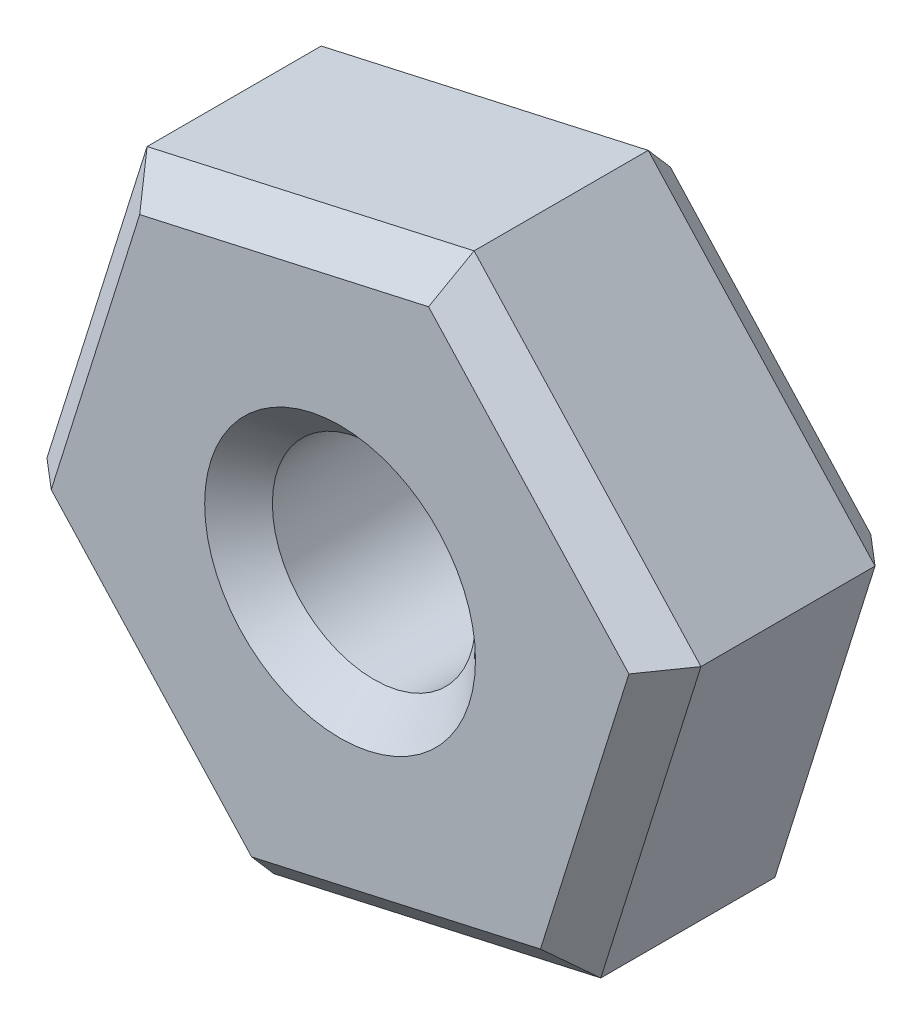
ISO-10303-21;
HEADER;
FILE_DESCRIPTION(('STEP AP214'),'2;1');
FILE_NAME('part.step','',(''),(''),'','','');
FILE_SCHEMA(('AUTOMOTIVE_DESIGN { 1 0 10303 214 1 1 1 1 }'));
ENDSEC;
DATA;
#1=APPLICATION_CONTEXT('core data for automotive mechanical design processes');
#2=APPLICATION_PROTOCOL_DEFINITION('international standard','automotive_design',2000,#1);
#3=PRODUCT_CONTEXT('',#1,'mechanical');
#4=PRODUCT('Part','Part','',(#3));
#5=PRODUCT_RELATED_PRODUCT_CATEGORY('part','',(#4));
#6=PRODUCT_DEFINITION_FORMATION('','',#4);
#7=PRODUCT_DEFINITION_CONTEXT('part definition',#1,'design');
#8=PRODUCT_DEFINITION('design','',#6,#7);
#9=PRODUCT_DEFINITION_SHAPE('','',#8);
#10=(LENGTH_UNIT() NAMED_UNIT(*) SI_UNIT(.MILLI.,.METRE.));
#11=(NAMED_UNIT(*) PLANE_ANGLE_UNIT() SI_UNIT($,.RADIAN.));
#12=(NAMED_UNIT(*) SI_UNIT($,.STERADIAN.) SOLID_ANGLE_UNIT());
#13=UNCERTAINTY_MEASURE_WITH_UNIT(LENGTH_MEASURE(1.E-05),#10,'distance_accuracy_value','');
#14=(GEOMETRIC_REPRESENTATION_CONTEXT(3) GLOBAL_UNCERTAINTY_ASSIGNED_CONTEXT((#13)) GLOBAL_UNIT_ASSIGNED_CONTEXT((#10,
#11,#12)) REPRESENTATION_CONTEXT('',''));
#15=CARTESIAN_POINT('',(0.,0.,0.));
#16=DIRECTION('',(0.,0.,1.));
#17=DIRECTION('',(1.,0.,0.));
#18=AXIS2_PLACEMENT_3D('',#15,#16,#17);
#19=CARTESIAN_POINT('',(-2.0706265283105,-6.61154337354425,5.));
#20=DIRECTION('',(-0.21831872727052,0.975877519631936,0.));
#21=DIRECTION('',(-0.975877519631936,-0.21831872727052,0.));
#22=AXIS2_PLACEMENT_3D('',#19,#20,#21);
#23=PLANE('',#22);
#24=DIRECTION('',(0.,0.,-1.));
#25=VECTOR('',#24,1.);
#26=CARTESIAN_POINT('',(-2.0706265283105,-6.61154337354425,5.));
#27=LINE('',#26,#25);
#28=CARTESIAN_POINT('',(-2.0706265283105,-6.61154337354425,4.3));
#29=VERTEX_POINT('',#28);
#30=CARTESIAN_POINT('',(-2.0706265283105,-6.61154337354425,0.7));
#31=VERTEX_POINT('',#30);
#32=EDGE_CURVE('E214',#29,#31,#27,.T.);
#33=ORIENTED_EDGE('',*,*,#32,.T.);
#34=DIRECTION('',(0.975877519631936,0.21831872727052,0.));
#35=VECTOR('',#34,1.);
#36=CARTESIAN_POINT('',(-2.0706265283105,-6.61154337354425,0.7));
#37=LINE('',#36,#35);
#38=CARTESIAN_POINT('',(4.69045125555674,-5.098986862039,0.7));
#39=VERTEX_POINT('',#38);
#40=EDGE_CURVE('E180',#31,#39,#37,.T.);
#41=ORIENTED_EDGE('',*,*,#40,.T.);
#42=DIRECTION('',(0.,0.,-1.));
#43=VECTOR('',#42,1.);
#44=CARTESIAN_POINT('',(4.69045125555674,-5.098986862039,5.));
#45=LINE('',#44,#43);
#46=CARTESIAN_POINT('',(4.69045125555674,-5.098986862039,4.3));
#47=VERTEX_POINT('',#46);
#48=EDGE_CURVE('E130',#47,#39,#45,.T.);
#49=ORIENTED_EDGE('',*,*,#48,.F.);
#50=DIRECTION('',(-0.975877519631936,-0.21831872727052,0.));
#51=VECTOR('',#50,1.);
#52=CARTESIAN_POINT('',(-2.0706265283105,-6.61154337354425,4.3));
#53=LINE('',#52,#51);
#54=EDGE_CURVE('E178',#47,#29,#53,.T.);
#55=ORIENTED_EDGE('',*,*,#54,.T.);
#56=EDGE_LOOP('',(#33,#41,#49,#55));
#57=FACE_BOUND('',#56,.T.);
#58=ADVANCED_FACE('F18',(#57),#23,.F.);
#59=CARTESIAN_POINT('',(4.69045125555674,-5.098986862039,5.));
#60=DIRECTION('',(-0.954294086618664,0.298869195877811,0.));
#61=DIRECTION('',(-0.298869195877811,-0.954294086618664,0.));
#62=AXIS2_PLACEMENT_3D('',#59,#60,#61);
#63=PLANE('',#62);
#64=ORIENTED_EDGE('',*,*,#48,.T.);
#65=DIRECTION('',(0.298869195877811,0.954294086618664,0.));
#66=VECTOR('',#65,1.);
#67=CARTESIAN_POINT('',(4.69045125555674,-5.098986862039,0.7));
#68=LINE('',#67,#66);
#69=CARTESIAN_POINT('',(6.76107778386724,1.51255651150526,0.7));
#70=VERTEX_POINT('',#69);
#71=EDGE_CURVE('E129',#39,#70,#68,.T.);
#72=ORIENTED_EDGE('',*,*,#71,.T.);
#73=DIRECTION('',(0.,0.,-1.));
#74=VECTOR('',#73,1.);
#75=CARTESIAN_POINT('',(6.76107778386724,1.51255651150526,5.));
#76=LINE('',#75,#74);
#77=CARTESIAN_POINT('',(6.76107778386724,1.51255651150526,4.3));
#78=VERTEX_POINT('',#77);
#79=EDGE_CURVE('E111',#78,#70,#76,.T.);
#80=ORIENTED_EDGE('',*,*,#79,.F.);
#81=DIRECTION('',(-0.298869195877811,-0.954294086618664,0.));
#82=VECTOR('',#81,1.);
#83=CARTESIAN_POINT('',(4.69045125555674,-5.098986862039,4.3));
#84=LINE('',#83,#82);
#85=EDGE_CURVE('E126',#78,#47,#84,.T.);
#86=ORIENTED_EDGE('',*,*,#85,.T.);
#87=EDGE_LOOP('',(#64,#72,#80,#86));
#88=FACE_BOUND('',#87,.T.);
#89=ADVANCED_FACE('F124',(#88),#63,.F.);
#90=CARTESIAN_POINT('',(6.76107778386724,1.51255651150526,5.));
#91=DIRECTION('',(-0.735975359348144,-0.677008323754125,0.));
#92=DIRECTION('',(0.677008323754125,-0.735975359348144,0.));
#93=AXIS2_PLACEMENT_3D('',#90,#91,#92);
#94=PLANE('',#93);
#95=ORIENTED_EDGE('',*,*,#79,.T.);
#96=DIRECTION('',(-0.677008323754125,0.735975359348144,0.));
#97=VECTOR('',#96,1.);
#98=CARTESIAN_POINT('',(6.76107778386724,1.51255651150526,0.7));
#99=LINE('',#98,#97);
#100=CARTESIAN_POINT('',(2.0706265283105,6.61154337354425,0.7));
#101=VERTEX_POINT('',#100);
#102=EDGE_CURVE('E118',#70,#101,#99,.T.);
#103=ORIENTED_EDGE('',*,*,#102,.T.);
#104=DIRECTION('',(0.,0.,-1.));
#105=VECTOR('',#104,1.);
#106=CARTESIAN_POINT('',(2.0706265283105,6.61154337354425,5.));
#107=LINE('',#106,#105);
#108=CARTESIAN_POINT('',(2.0706265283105,6.61154337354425,4.3));
#109=VERTEX_POINT('',#108);
#110=EDGE_CURVE('E113',#109,#101,#107,.T.);
#111=ORIENTED_EDGE('',*,*,#110,.F.);
#112=DIRECTION('',(0.677008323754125,-0.735975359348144,0.));
#113=VECTOR('',#112,1.);
#114=CARTESIAN_POINT('',(6.76107778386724,1.51255651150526,4.3));
#115=LINE('',#114,#113);
#116=EDGE_CURVE('E108',#109,#78,#115,.T.);
#117=ORIENTED_EDGE('',*,*,#116,.T.);
#118=EDGE_LOOP('',(#95,#103,#111,#117));
#119=FACE_BOUND('',#118,.T.);
#120=ADVANCED_FACE('F110',(#119),#94,.F.);
#121=CARTESIAN_POINT('',(2.0706265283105,6.61154337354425,5.));
#122=DIRECTION('',(0.21831872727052,-0.975877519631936,0.));
#123=DIRECTION('',(0.975877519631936,0.21831872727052,0.));
#124=AXIS2_PLACEMENT_3D('',#121,#122,#123);
#125=PLANE('',#124);
#126=ORIENTED_EDGE('',*,*,#110,.T.);
#127=DIRECTION('',(-0.975877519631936,-0.21831872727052,0.));
#128=VECTOR('',#127,1.);
#129=CARTESIAN_POINT('',(2.0706265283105,6.61154337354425,0.7));
#130=LINE('',#129,#128);
#131=CARTESIAN_POINT('',(-4.69045125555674,5.09898686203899,0.7));
#132=VERTEX_POINT('',#131);
#133=EDGE_CURVE('E167',#101,#132,#130,.T.);
#134=ORIENTED_EDGE('',*,*,#133,.T.);
#135=DIRECTION('',(0.,0.,-1.));
#136=VECTOR('',#135,1.);
#137=CARTESIAN_POINT('',(-4.69045125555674,5.09898686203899,5.));
#138=LINE('',#137,#136);
#139=CARTESIAN_POINT('',(-4.69045125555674,5.09898686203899,4.3));
#140=VERTEX_POINT('',#139);
#141=EDGE_CURVE('E232',#140,#132,#138,.T.);
#142=ORIENTED_EDGE('',*,*,#141,.F.);
#143=DIRECTION('',(0.975877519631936,0.21831872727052,0.));
#144=VECTOR('',#143,1.);
#145=CARTESIAN_POINT('',(2.0706265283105,6.61154337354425,4.3));
#146=LINE('',#145,#144);
#147=EDGE_CURVE('E165',#140,#109,#146,.T.);
#148=ORIENTED_EDGE('',*,*,#147,.T.);
#149=EDGE_LOOP('',(#126,#134,#142,#148));
#150=FACE_BOUND('',#149,.T.);
#151=ADVANCED_FACE('F229',(#150),#125,.F.);
#152=CARTESIAN_POINT('',(-4.69045125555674,5.09898686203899,5.));
#153=DIRECTION('',(0.954294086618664,-0.298869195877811,0.));
#154=DIRECTION('',(0.298869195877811,0.954294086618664,0.));
#155=AXIS2_PLACEMENT_3D('',#152,#153,#154);
#156=PLANE('',#155);
#157=ORIENTED_EDGE('',*,*,#141,.T.);
#158=DIRECTION('',(-0.298869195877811,-0.954294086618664,0.));
#159=VECTOR('',#158,1.);
#160=CARTESIAN_POINT('',(-4.69045125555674,5.09898686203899,0.7));
#161=LINE('',#160,#159);
#162=CARTESIAN_POINT('',(-6.76107778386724,-1.51255651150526,0.7));
#163=VERTEX_POINT('',#162);
#164=EDGE_CURVE('E171',#132,#163,#161,.T.);
#165=ORIENTED_EDGE('',*,*,#164,.T.);
#166=DIRECTION('',(0.,0.,-1.));
#167=VECTOR('',#166,1.);
#168=CARTESIAN_POINT('',(-6.76107778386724,-1.51255651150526,5.));
#169=LINE('',#168,#167);
#170=CARTESIAN_POINT('',(-6.76107778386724,-1.51255651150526,4.3));
#171=VERTEX_POINT('',#170);
#172=EDGE_CURVE('E235',#171,#163,#169,.T.);
#173=ORIENTED_EDGE('',*,*,#172,.F.);
#174=DIRECTION('',(0.298869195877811,0.954294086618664,0.));
#175=VECTOR('',#174,1.);
#176=CARTESIAN_POINT('',(-4.69045125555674,5.09898686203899,4.3));
#177=LINE('',#176,#175);
#178=EDGE_CURVE('E169',#171,#140,#177,.T.);
#179=ORIENTED_EDGE('',*,*,#178,.T.);
#180=EDGE_LOOP('',(#157,#165,#173,#179));
#181=FACE_BOUND('',#180,.T.);
#182=ADVANCED_FACE('F274',(#181),#156,.F.);
#183=CARTESIAN_POINT('',(-6.76107778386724,-1.51255651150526,5.));
#184=DIRECTION('',(0.735975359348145,0.677008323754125,0.));
#185=DIRECTION('',(-0.677008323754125,0.735975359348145,0.));
#186=AXIS2_PLACEMENT_3D('',#183,#184,#185);
#187=PLANE('',#186);
#188=ORIENTED_EDGE('',*,*,#172,.T.);
#189=DIRECTION('',(0.677008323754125,-0.735975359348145,0.));
#190=VECTOR('',#189,1.);
#191=CARTESIAN_POINT('',(-6.76107778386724,-1.51255651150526,0.7));
#192=LINE('',#191,#190);
#193=EDGE_CURVE('E176',#163,#31,#192,.T.);
#194=ORIENTED_EDGE('',*,*,#193,.T.);
#195=ORIENTED_EDGE('',*,*,#32,.F.);
#196=DIRECTION('',(-0.677008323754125,0.735975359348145,0.));
#197=VECTOR('',#196,1.);
#198=CARTESIAN_POINT('',(-6.76107778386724,-1.51255651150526,4.3));
#199=LINE('',#198,#197);
#200=EDGE_CURVE('E173',#29,#171,#199,.T.);
#201=ORIENTED_EDGE('',*,*,#200,.T.);
#202=EDGE_LOOP('',(#188,#194,#195,#201));
#203=FACE_BOUND('',#202,.T.);
#204=ADVANCED_FACE('F275',(#203),#187,.F.);
#205=CARTESIAN_POINT('',(0.,0.,5.));
#206=DIRECTION('',(0.,0.,1.));
#207=DIRECTION('',(1.,0.,0.));
#208=AXIS2_PLACEMENT_3D('',#205,#206,#207);
#209=PLANE('',#208);
#210=DIRECTION('',(-0.298869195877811,-0.954294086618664,0.));
#211=VECTOR('',#210,1.);
#212=CARTESIAN_POINT('',(-6.09307192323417,-1.72176494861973,5.));
#213=LINE('',#212,#211);
#214=CARTESIAN_POINT('',(-4.14323194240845,4.50410506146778,5.));
#215=VERTEX_POINT('',#214);
#216=CARTESIAN_POINT('',(-5.97228537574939,-1.33609158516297,5.));
#217=VERTEX_POINT('',#216);
#218=EDGE_CURVE('E27',#215,#217,#213,.T.);
#219=ORIENTED_EDGE('',*,*,#218,.T.);
#220=DIRECTION('',(0.677008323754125,-0.735975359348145,0.));
#221=VECTOR('',#220,1.);
#222=CARTESIAN_POINT('',(-1.5554437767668,-6.13763754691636,5.));
#223=LINE('',#222,#221);
#224=CARTESIAN_POINT('',(-1.82905343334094,-5.84019664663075,5.));
#225=VERTEX_POINT('',#224);
#226=EDGE_CURVE('E11',#217,#225,#223,.T.);
#227=ORIENTED_EDGE('',*,*,#226,.T.);
#228=DIRECTION('',(0.975877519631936,0.21831872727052,0.));
#229=VECTOR('',#228,1.);
#230=CARTESIAN_POINT('',(4.53762814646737,-4.41587259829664,5.));
#231=LINE('',#230,#229);
#232=CARTESIAN_POINT('',(4.14323194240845,-4.50410506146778,5.));
#233=VERTEX_POINT('',#232);
#234=EDGE_CURVE('E191',#225,#233,#231,.T.);
#235=ORIENTED_EDGE('',*,*,#234,.T.);
#236=DIRECTION('',(0.298869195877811,0.954294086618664,0.));
#237=VECTOR('',#236,1.);
#238=CARTESIAN_POINT('',(6.09307192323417,1.72176494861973,5.));
#239=LINE('',#238,#237);
#240=CARTESIAN_POINT('',(5.97228537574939,1.33609158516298,5.));
#241=VERTEX_POINT('',#240);
#242=EDGE_CURVE('E193',#233,#241,#239,.T.);
#243=ORIENTED_EDGE('',*,*,#242,.T.);
#244=DIRECTION('',(-0.677008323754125,0.735975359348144,0.));
#245=VECTOR('',#244,1.);
#246=CARTESIAN_POINT('',(1.5554437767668,6.13763754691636,5.));
#247=LINE('',#246,#245);
#248=CARTESIAN_POINT('',(1.82905343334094,5.84019664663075,5.));
#249=VERTEX_POINT('',#248);
#250=EDGE_CURVE('E136',#241,#249,#247,.T.);
#251=ORIENTED_EDGE('',*,*,#250,.T.);
#252=DIRECTION('',(-0.975877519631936,-0.21831872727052,0.));
#253=VECTOR('',#252,1.);
#254=CARTESIAN_POINT('',(-4.53762814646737,4.41587259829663,5.));
#255=LINE('',#254,#253);
#256=EDGE_CURVE('E38',#249,#215,#255,.T.);
#257=ORIENTED_EDGE('',*,*,#256,.T.);
#258=EDGE_LOOP('',(#219,#227,#235,#243,#251,#257));
#259=FACE_BOUND('',#258,.T.);
#260=CARTESIAN_POINT('',(0.,0.,5.));
#261=DIRECTION('',(0.,0.,1.));
#262=DIRECTION('',(1.,0.,0.));
#263=AXIS2_PLACEMENT_3D('',#260,#261,#262);
#264=CIRCLE('',#263,2.8);
#265=CARTESIAN_POINT('',(2.8,0.,5.));
#266=VERTEX_POINT('',#265);
#267=EDGE_CURVE('E188',#266,#266,#264,.F.);
#268=ORIENTED_EDGE('',*,*,#267,.T.);
#269=EDGE_LOOP('',(#268));
#270=FACE_BOUND('',#269,.T.);
#271=ADVANCED_FACE('F283',(#259,#270),#209,.T.);
#272=CARTESIAN_POINT('',(0.,0.,0.));
#273=DIRECTION('',(0.,0.,1.));
#274=DIRECTION('',(1.,0.,0.));
#275=AXIS2_PLACEMENT_3D('',#272,#273,#274);
#276=PLANE('',#275);
#277=DIRECTION('',(0.677008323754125,-0.735975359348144,0.));
#278=VECTOR('',#277,1.);
#279=CARTESIAN_POINT('',(3.90066940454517,3.58814411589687,0.));
#280=LINE('',#279,#278);
#281=CARTESIAN_POINT('',(1.82905343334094,5.84019664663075,0.));
#282=VERTEX_POINT('',#281);
#283=CARTESIAN_POINT('',(5.97228537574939,1.33609158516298,0.));
#284=VERTEX_POINT('',#283);
#285=EDGE_CURVE('E160',#282,#284,#280,.T.);
#286=ORIENTED_EDGE('',*,*,#285,.T.);
#287=DIRECTION('',(-0.298869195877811,-0.954294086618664,0.));
#288=VECTOR('',#287,1.);
#289=CARTESIAN_POINT('',(5.05775865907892,-1.5840067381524,0.));
#290=LINE('',#289,#288);
#291=CARTESIAN_POINT('',(4.14323194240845,-4.50410506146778,0.));
#292=VERTEX_POINT('',#291);
#293=EDGE_CURVE('E119',#284,#292,#290,.T.);
#294=ORIENTED_EDGE('',*,*,#293,.T.);
#295=DIRECTION('',(-0.975877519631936,-0.21831872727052,0.));
#296=VECTOR('',#295,1.);
#297=CARTESIAN_POINT('',(1.15708925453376,-5.17215085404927,0.));
#298=LINE('',#297,#296);
#299=CARTESIAN_POINT('',(-1.82905343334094,-5.84019664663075,0.));
#300=VERTEX_POINT('',#299);
#301=EDGE_CURVE('E152',#292,#300,#298,.T.);
#302=ORIENTED_EDGE('',*,*,#301,.T.);
#303=DIRECTION('',(-0.677008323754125,0.735975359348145,0.));
#304=VECTOR('',#303,1.);
#305=CARTESIAN_POINT('',(-3.90066940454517,-3.58814411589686,0.));
#306=LINE('',#305,#304);
#307=CARTESIAN_POINT('',(-5.97228537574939,-1.33609158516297,0.));
#308=VERTEX_POINT('',#307);
#309=EDGE_CURVE('E154',#300,#308,#306,.T.);
#310=ORIENTED_EDGE('',*,*,#309,.T.);
#311=DIRECTION('',(0.298869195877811,0.954294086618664,0.));
#312=VECTOR('',#311,1.);
#313=CARTESIAN_POINT('',(-5.05775865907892,1.5840067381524,0.));
#314=LINE('',#313,#312);
#315=CARTESIAN_POINT('',(-4.14323194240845,4.50410506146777,0.));
#316=VERTEX_POINT('',#315);
#317=EDGE_CURVE('E156',#308,#316,#314,.T.);
#318=ORIENTED_EDGE('',*,*,#317,.T.);
#319=DIRECTION('',(0.975877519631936,0.21831872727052,0.));
#320=VECTOR('',#319,1.);
#321=CARTESIAN_POINT('',(-1.15708925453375,5.17215085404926,0.));
#322=LINE('',#321,#320);
#323=EDGE_CURVE('E158',#316,#282,#322,.T.);
#324=ORIENTED_EDGE('',*,*,#323,.T.);
#325=EDGE_LOOP('',(#286,#294,#302,#310,#318,#324));
#326=FACE_BOUND('',#325,.T.);
#327=CARTESIAN_POINT('',(0.,0.,0.));
#328=DIRECTION('',(0.,0.,1.));
#329=DIRECTION('',(1.,0.,0.));
#330=AXIS2_PLACEMENT_3D('',#327,#328,#329);
#331=CIRCLE('',#330,2.8);
#332=CARTESIAN_POINT('',(2.8,0.,0.));
#333=VERTEX_POINT('',#332);
#334=EDGE_CURVE('E146',#333,#333,#331,.T.);
#335=ORIENTED_EDGE('',*,*,#334,.T.);
#336=EDGE_LOOP('',(#335));
#337=FACE_BOUND('',#336,.T.);
#338=ADVANCED_FACE('F286',(#326,#337),#276,.F.);
#339=CARTESIAN_POINT('',(0.,0.,0.));
#340=DIRECTION('',(0.,0.,-1.));
#341=DIRECTION('',(-1.,0.,0.));
#342=AXIS2_PLACEMENT_3D('',#339,#340,#341);
#343=CYLINDRICAL_SURFACE('',#342,2.1);
#344=CARTESIAN_POINT('',(0.,0.,0.7));
#345=DIRECTION('',(0.,0.,1.));
#346=DIRECTION('',(1.,0.,0.));
#347=AXIS2_PLACEMENT_3D('',#344,#345,#346);
#348=CIRCLE('',#347,2.1);
#349=CARTESIAN_POINT('',(2.1,0.,0.7));
#350=VERTEX_POINT('',#349);
#351=EDGE_CURVE('E185',#350,#350,#348,.F.);
#352=ORIENTED_EDGE('',*,*,#351,.T.);
#353=EDGE_LOOP('',(#352));
#354=FACE_BOUND('',#353,.T.);
#355=CARTESIAN_POINT('',(0.,0.,4.3));
#356=DIRECTION('',(0.,0.,1.));
#357=DIRECTION('',(1.,0.,0.));
#358=AXIS2_PLACEMENT_3D('',#355,#356,#357);
#359=CIRCLE('',#358,2.1);
#360=CARTESIAN_POINT('',(2.1,0.,4.3));
#361=VERTEX_POINT('',#360);
#362=EDGE_CURVE('E182',#361,#361,#359,.T.);
#363=ORIENTED_EDGE('',*,*,#362,.T.);
#364=EDGE_LOOP('',(#363));
#365=FACE_BOUND('',#364,.T.);
#366=ADVANCED_FACE('F321',(#354,#365),#343,.F.);
#367=CARTESIAN_POINT('',(-4.69045125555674,5.09898686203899,0.7));
#368=DIRECTION('',(0.674787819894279,-0.211332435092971,0.707106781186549));
#369=DIRECTION('',(-0.298869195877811,-0.954294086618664,0.));
#370=AXIS2_PLACEMENT_3D('',#367,#368,#369);
#371=PLANE('',#370);
#372=DIRECTION('',(0.511770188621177,-0.556345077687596,-0.654653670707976));
#373=VECTOR('',#372,1.);
#374=CARTESIAN_POINT('',(-4.69045125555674,5.09898686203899,0.7));
#375=LINE('',#374,#373);
#376=EDGE_CURVE('E208',#316,#132,#375,.F.);
#377=ORIENTED_EDGE('',*,*,#376,.F.);
#378=ORIENTED_EDGE('',*,*,#317,.F.);
#379=DIRECTION('',(0.737694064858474,0.165033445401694,-0.654653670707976));
#380=VECTOR('',#379,1.);
#381=CARTESIAN_POINT('',(-6.76107778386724,-1.51255651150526,0.7));
#382=LINE('',#381,#380);
#383=EDGE_CURVE('E211',#163,#308,#382,.T.);
#384=ORIENTED_EDGE('',*,*,#383,.F.);
#385=ORIENTED_EDGE('',*,*,#164,.F.);
#386=EDGE_LOOP('',(#377,#378,#384,#385));
#387=FACE_BOUND('',#386,.T.);
#388=ADVANCED_FACE('F271',(#387),#371,.F.);
#389=CARTESIAN_POINT('',(-6.76107778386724,-1.51255651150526,0.7));
#390=DIRECTION('',(0.520413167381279,0.478717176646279,0.707106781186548));
#391=DIRECTION('',(0.677008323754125,-0.735975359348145,0.));
#392=AXIS2_PLACEMENT_3D('',#389,#390,#391);
#393=PLANE('',#392);
#394=ORIENTED_EDGE('',*,*,#383,.T.);
#395=ORIENTED_EDGE('',*,*,#309,.F.);
#396=DIRECTION('',(0.225923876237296,0.721378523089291,-0.654653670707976));
#397=VECTOR('',#396,1.);
#398=CARTESIAN_POINT('',(-2.0706265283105,-6.61154337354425,0.7));
#399=LINE('',#398,#397);
#400=EDGE_CURVE('E205',#31,#300,#399,.T.);
#401=ORIENTED_EDGE('',*,*,#400,.F.);
#402=ORIENTED_EDGE('',*,*,#193,.F.);
#403=EDGE_LOOP('',(#394,#395,#401,#402));
#404=FACE_BOUND('',#403,.T.);
#405=ADVANCED_FACE('F251',(#404),#393,.F.);
#406=CARTESIAN_POINT('',(2.0706265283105,6.61154337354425,0.7));
#407=DIRECTION('',(0.154374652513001,-0.69004961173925,0.707106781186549));
#408=DIRECTION('',(-0.975877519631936,-0.21831872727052,0.));
#409=AXIS2_PLACEMENT_3D('',#406,#407,#408);
#410=PLANE('',#409);
#411=ORIENTED_EDGE('',*,*,#376,.T.);
#412=ORIENTED_EDGE('',*,*,#133,.F.);
#413=DIRECTION('',(-0.225923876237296,-0.721378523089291,-0.654653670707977));
#414=VECTOR('',#413,1.);
#415=CARTESIAN_POINT('',(2.0706265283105,6.61154337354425,0.7));
#416=LINE('',#415,#414);
#417=EDGE_CURVE('E202',#282,#101,#416,.F.);
#418=ORIENTED_EDGE('',*,*,#417,.F.);
#419=ORIENTED_EDGE('',*,*,#323,.F.);
#420=EDGE_LOOP('',(#411,#412,#418,#419));
#421=FACE_BOUND('',#420,.T.);
#422=ADVANCED_FACE('F267',(#421),#410,.F.);
#423=CARTESIAN_POINT('',(-2.0706265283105,-6.61154337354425,0.7));
#424=DIRECTION('',(-0.154374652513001,0.690049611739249,0.707106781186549));
#425=DIRECTION('',(0.975877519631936,0.21831872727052,0.));
#426=AXIS2_PLACEMENT_3D('',#423,#424,#425);
#427=PLANE('',#426);
#428=ORIENTED_EDGE('',*,*,#400,.T.);
#429=ORIENTED_EDGE('',*,*,#301,.F.);
#430=DIRECTION('',(0.511770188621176,-0.556345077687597,0.654653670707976));
#431=VECTOR('',#430,1.);
#432=CARTESIAN_POINT('',(3.35032232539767,-3.642133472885,-1.01428571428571));
#433=LINE('',#432,#431);
#434=EDGE_CURVE('E200',#39,#292,#433,.F.);
#435=ORIENTED_EDGE('',*,*,#434,.F.);
#436=ORIENTED_EDGE('',*,*,#40,.F.);
#437=EDGE_LOOP('',(#428,#429,#435,#436));
#438=FACE_BOUND('',#437,.T.);
#439=ADVANCED_FACE('F255',(#438),#427,.F.);
#440=CARTESIAN_POINT('',(6.76107778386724,1.51255651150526,0.7));
#441=DIRECTION('',(-0.520413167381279,-0.478717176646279,0.707106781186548));
#442=DIRECTION('',(-0.677008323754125,0.735975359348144,0.));
#443=AXIS2_PLACEMENT_3D('',#440,#441,#442);
#444=PLANE('',#443);
#445=ORIENTED_EDGE('',*,*,#417,.T.);
#446=ORIENTED_EDGE('',*,*,#102,.F.);
#447=DIRECTION('',(-0.737694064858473,-0.165033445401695,-0.654653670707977));
#448=VECTOR('',#447,1.);
#449=CARTESIAN_POINT('',(6.76107778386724,1.51255651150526,0.7));
#450=LINE('',#449,#448);
#451=EDGE_CURVE('E198',#284,#70,#450,.F.);
#452=ORIENTED_EDGE('',*,*,#451,.F.);
#453=ORIENTED_EDGE('',*,*,#285,.F.);
#454=EDGE_LOOP('',(#445,#446,#452,#453));
#455=FACE_BOUND('',#454,.T.);
#456=ADVANCED_FACE('F263',(#455),#444,.F.);
#457=CARTESIAN_POINT('',(4.69045125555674,-5.098986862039,0.7));
#458=DIRECTION('',(-0.67478781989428,0.211332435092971,0.707106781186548));
#459=DIRECTION('',(0.298869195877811,0.954294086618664,0.));
#460=AXIS2_PLACEMENT_3D('',#457,#458,#459);
#461=PLANE('',#460);
#462=ORIENTED_EDGE('',*,*,#434,.T.);
#463=ORIENTED_EDGE('',*,*,#293,.F.);
#464=ORIENTED_EDGE('',*,*,#451,.T.);
#465=ORIENTED_EDGE('',*,*,#71,.F.);
#466=EDGE_LOOP('',(#462,#463,#464,#465));
#467=FACE_BOUND('',#466,.T.);
#468=ADVANCED_FACE('F258',(#467),#461,.F.);
#469=CARTESIAN_POINT('',(0.,0.,0.7));
#470=DIRECTION('',(0.,0.,-1.));
#471=DIRECTION('',(-1.,0.,0.));
#472=AXIS2_PLACEMENT_3D('',#469,#470,#471);
#473=CONICAL_SURFACE('',#472,2.1,0.785398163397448);
#474=ORIENTED_EDGE('',*,*,#334,.F.);
#475=EDGE_LOOP('',(#474));
#476=FACE_BOUND('',#475,.T.);
#477=ORIENTED_EDGE('',*,*,#351,.F.);
#478=EDGE_LOOP('',(#477));
#479=FACE_BOUND('',#478,.T.);
#480=ADVANCED_FACE('F310',(#476,#479),#473,.F.);
#481=CARTESIAN_POINT('',(3.90066940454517,3.58814411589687,5.));
#482=DIRECTION('',(0.520413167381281,0.478717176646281,0.707106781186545));
#483=DIRECTION('',(0.677008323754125,-0.735975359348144,0.));
#484=AXIS2_PLACEMENT_3D('',#481,#482,#483);
#485=PLANE('',#484);
#486=DIRECTION('',(-0.737694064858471,-0.165033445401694,0.65465367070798));
#487=VECTOR('',#486,1.);
#488=CARTESIAN_POINT('',(5.11910175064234,1.14522135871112,5.75714285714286));
#489=LINE('',#488,#487);
#490=EDGE_CURVE('E134',#78,#241,#489,.T.);
#491=ORIENTED_EDGE('',*,*,#490,.F.);
#492=ORIENTED_EDGE('',*,*,#116,.F.);
#493=DIRECTION('',(-0.225923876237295,-0.721378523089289,0.654653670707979));
#494=VECTOR('',#493,1.);
#495=CARTESIAN_POINT('',(1.56776008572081,5.00588283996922,5.75714285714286));
#496=LINE('',#495,#494);
#497=EDGE_CURVE('E22',#249,#109,#496,.F.);
#498=ORIENTED_EDGE('',*,*,#497,.F.);
#499=ORIENTED_EDGE('',*,*,#250,.F.);
#500=EDGE_LOOP('',(#491,#492,#498,#499));
#501=FACE_BOUND('',#500,.T.);
#502=ADVANCED_FACE('F135',(#501),#485,.T.);
#503=CARTESIAN_POINT('',(-1.15708925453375,5.17215085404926,5.));
#504=DIRECTION('',(-0.154374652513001,0.690049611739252,0.707106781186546));
#505=DIRECTION('',(0.975877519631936,0.21831872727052,0.));
#506=AXIS2_PLACEMENT_3D('',#503,#504,#505);
#507=PLANE('',#506);
#508=ORIENTED_EDGE('',*,*,#497,.T.);
#509=ORIENTED_EDGE('',*,*,#147,.F.);
#510=DIRECTION('',(0.511770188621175,-0.556345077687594,0.654653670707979));
#511=VECTOR('',#510,1.);
#512=CARTESIAN_POINT('',(-3.55134166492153,3.8606614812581,5.75714285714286));
#513=LINE('',#512,#511);
#514=EDGE_CURVE('E139',#215,#140,#513,.F.);
#515=ORIENTED_EDGE('',*,*,#514,.F.);
#516=ORIENTED_EDGE('',*,*,#256,.F.);
#517=EDGE_LOOP('',(#508,#509,#515,#516));
#518=FACE_BOUND('',#517,.T.);
#519=ADVANCED_FACE('F226',(#518),#507,.T.);
#520=CARTESIAN_POINT('',(5.05775865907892,-1.5840067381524,5.));
#521=DIRECTION('',(0.674787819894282,-0.211332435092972,0.707106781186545));
#522=DIRECTION('',(-0.298869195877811,-0.954294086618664,0.));
#523=AXIS2_PLACEMENT_3D('',#520,#521,#522);
#524=PLANE('',#523);
#525=ORIENTED_EDGE('',*,*,#490,.T.);
#526=ORIENTED_EDGE('',*,*,#242,.F.);
#527=DIRECTION('',(-0.511770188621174,0.556345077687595,0.654653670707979));
#528=VECTOR('',#527,1.);
#529=CARTESIAN_POINT('',(3.55134166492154,-3.8606614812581,5.75714285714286));
#530=LINE('',#529,#528);
#531=EDGE_CURVE('E143',#47,#233,#530,.T.);
#532=ORIENTED_EDGE('',*,*,#531,.F.);
#533=ORIENTED_EDGE('',*,*,#85,.F.);
#534=EDGE_LOOP('',(#525,#526,#532,#533));
#535=FACE_BOUND('',#534,.T.);
#536=ADVANCED_FACE('F141',(#535),#524,.T.);
#537=CARTESIAN_POINT('',(-5.05775865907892,1.5840067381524,5.));
#538=DIRECTION('',(-0.674787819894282,0.211332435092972,0.707106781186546));
#539=DIRECTION('',(0.298869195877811,0.954294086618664,0.));
#540=AXIS2_PLACEMENT_3D('',#537,#538,#539);
#541=PLANE('',#540);
#542=ORIENTED_EDGE('',*,*,#514,.T.);
#543=ORIENTED_EDGE('',*,*,#178,.F.);
#544=DIRECTION('',(0.737694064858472,0.165033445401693,0.654653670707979));
#545=VECTOR('',#544,1.);
#546=CARTESIAN_POINT('',(-5.11910175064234,-1.14522135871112,5.75714285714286));
#547=LINE('',#546,#545);
#548=EDGE_CURVE('E217',#217,#171,#547,.F.);
#549=ORIENTED_EDGE('',*,*,#548,.F.);
#550=ORIENTED_EDGE('',*,*,#218,.F.);
#551=EDGE_LOOP('',(#542,#543,#549,#550));
#552=FACE_BOUND('',#551,.T.);
#553=ADVANCED_FACE('F223',(#552),#541,.T.);
#554=CARTESIAN_POINT('',(1.15708925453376,-5.17215085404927,5.));
#555=DIRECTION('',(0.154374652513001,-0.690049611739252,0.707106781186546));
#556=DIRECTION('',(-0.975877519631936,-0.21831872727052,0.));
#557=AXIS2_PLACEMENT_3D('',#554,#555,#556);
#558=PLANE('',#557);
#559=ORIENTED_EDGE('',*,*,#531,.T.);
#560=ORIENTED_EDGE('',*,*,#234,.F.);
#561=DIRECTION('',(-0.225923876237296,-0.721378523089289,-0.654653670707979));
#562=VECTOR('',#561,1.);
#563=CARTESIAN_POINT('',(-1.5677600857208,-5.00588283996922,5.75714285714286));
#564=LINE('',#563,#562);
#565=EDGE_CURVE('E215',#29,#225,#564,.F.);
#566=ORIENTED_EDGE('',*,*,#565,.F.);
#567=ORIENTED_EDGE('',*,*,#54,.F.);
#568=EDGE_LOOP('',(#559,#560,#566,#567));
#569=FACE_BOUND('',#568,.T.);
#570=ADVANCED_FACE('F282',(#569),#558,.T.);
#571=CARTESIAN_POINT('',(-3.90066940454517,-3.58814411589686,5.));
#572=DIRECTION('',(-0.520413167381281,-0.478717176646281,0.707106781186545));
#573=DIRECTION('',(-0.677008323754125,0.735975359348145,0.));
#574=AXIS2_PLACEMENT_3D('',#571,#572,#573);
#575=PLANE('',#574);
#576=ORIENTED_EDGE('',*,*,#548,.T.);
#577=ORIENTED_EDGE('',*,*,#200,.F.);
#578=ORIENTED_EDGE('',*,*,#565,.T.);
#579=ORIENTED_EDGE('',*,*,#226,.F.);
#580=EDGE_LOOP('',(#576,#577,#578,#579));
#581=FACE_BOUND('',#580,.T.);
#582=ADVANCED_FACE('F278',(#581),#575,.T.);
#583=CARTESIAN_POINT('',(0.,0.,5.));
#584=DIRECTION('',(0.,0.,1.));
#585=DIRECTION('',(1.,0.,0.));
#586=AXIS2_PLACEMENT_3D('',#583,#584,#585);
#587=CONICAL_SURFACE('',#586,2.8,0.785398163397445);
#588=ORIENTED_EDGE('',*,*,#362,.F.);
#589=EDGE_LOOP('',(#588));
#590=FACE_BOUND('',#589,.T.);
#591=ORIENTED_EDGE('',*,*,#267,.F.);
#592=EDGE_LOOP('',(#591));
#593=FACE_BOUND('',#592,.T.);
#594=ADVANCED_FACE('F20',(#590,#593),#587,.F.);
#595=CLOSED_SHELL('',(#58,#89,#120,#151,#182,#204,#271,#338,#366,#388,#405,#422,#439,#456,#468,
#480,#502,#519,#536,#553,#570,#582,#594));
#596=MANIFOLD_SOLID_BREP('B1',#595);
#597=ADVANCED_BREP_SHAPE_REPRESENTATION('',(#18,#596),#14);
#598=SHAPE_DEFINITION_REPRESENTATION(#9,#597);
ENDSEC;
END-ISO-10303-21;
